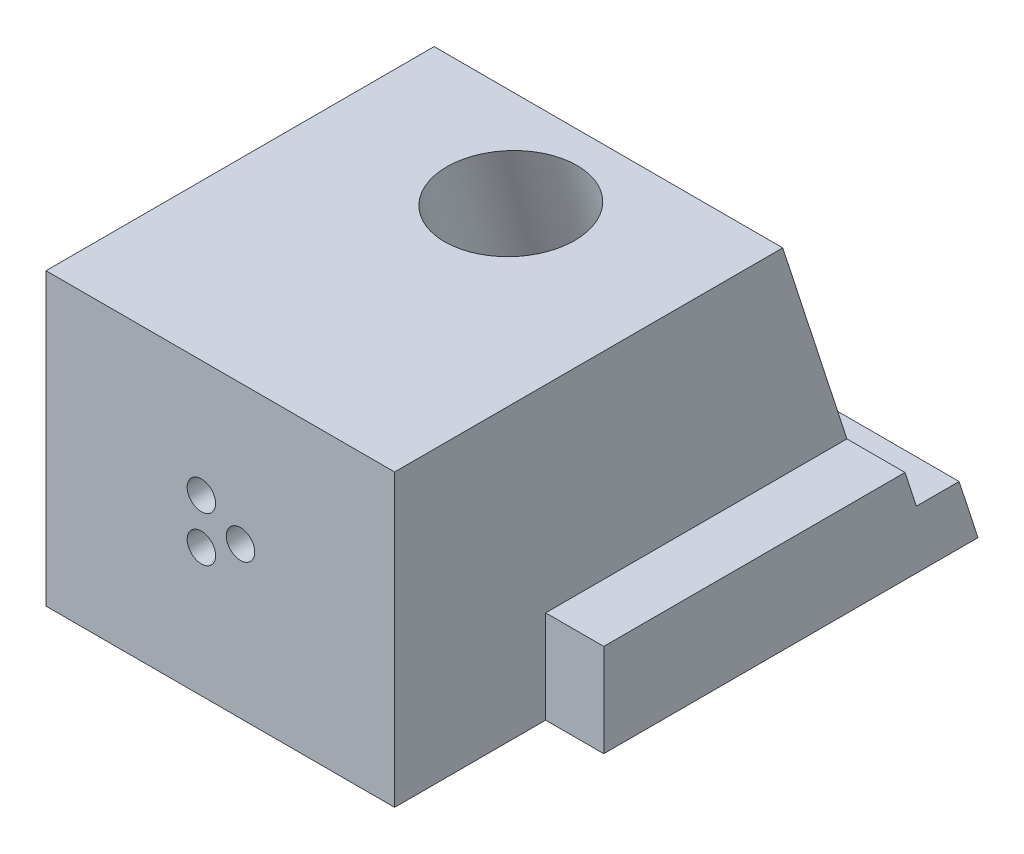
ISO-10303-21;
HEADER;
FILE_DESCRIPTION(('STEP AP214'),'2;1');
FILE_NAME('part.step','',(''),(''),'','','');
FILE_SCHEMA(('AUTOMOTIVE_DESIGN { 1 0 10303 214 1 1 1 1 }'));
ENDSEC;
DATA;
#1=APPLICATION_CONTEXT('core data for automotive mechanical design processes');
#2=APPLICATION_PROTOCOL_DEFINITION('international standard','automotive_design',2000,#1);
#3=PRODUCT_CONTEXT('',#1,'mechanical');
#4=PRODUCT('Part','Part','',(#3));
#5=PRODUCT_RELATED_PRODUCT_CATEGORY('part','',(#4));
#6=PRODUCT_DEFINITION_FORMATION('','',#4);
#7=PRODUCT_DEFINITION_CONTEXT('part definition',#1,'design');
#8=PRODUCT_DEFINITION('design','',#6,#7);
#9=PRODUCT_DEFINITION_SHAPE('','',#8);
#10=(LENGTH_UNIT() NAMED_UNIT(*) SI_UNIT(.MILLI.,.METRE.));
#11=(NAMED_UNIT(*) PLANE_ANGLE_UNIT() SI_UNIT($,.RADIAN.));
#12=(NAMED_UNIT(*) SI_UNIT($,.STERADIAN.) SOLID_ANGLE_UNIT());
#13=UNCERTAINTY_MEASURE_WITH_UNIT(LENGTH_MEASURE(1.E-05),#10,'distance_accuracy_value','');
#14=(GEOMETRIC_REPRESENTATION_CONTEXT(3) GLOBAL_UNCERTAINTY_ASSIGNED_CONTEXT((#13)) GLOBAL_UNIT_ASSIGNED_CONTEXT((#10,
#11,#12)) REPRESENTATION_CONTEXT('',''));
#15=CARTESIAN_POINT('',(0.,0.,0.));
#16=DIRECTION('',(0.,0.,1.));
#17=DIRECTION('',(1.,0.,0.));
#18=AXIS2_PLACEMENT_3D('',#15,#16,#17);
#19=CARTESIAN_POINT('',(-10.,-5.,-108.665097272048));
#20=DIRECTION('',(1.,0.,0.));
#21=DIRECTION('',(0.,1.,0.));
#22=AXIS2_PLACEMENT_3D('',#19,#20,#21);
#23=PLANE('',#22);
#24=DIRECTION('',(0.,0.951056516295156,0.309016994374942));
#25=VECTOR('',#24,1.);
#26=CARTESIAN_POINT('',(-10.,-17.6789576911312,-69.6432779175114));
#27=LINE('',#26,#25);
#28=CARTESIAN_POINT('',(-10.,-13.,-68.1229924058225));
#29=VERTEX_POINT('',#28);
#30=CARTESIAN_POINT('',(-9.99999999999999,-8.,-66.498393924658));
#31=VERTEX_POINT('',#30);
#32=EDGE_CURVE('E211',#29,#31,#27,.T.);
#33=ORIENTED_EDGE('',*,*,#32,.T.);
#34=DIRECTION('',(0.,0.,1.));
#35=VECTOR('',#34,1.);
#36=CARTESIAN_POINT('',(-9.99999999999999,-8.,-62.8182761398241));
#37=LINE('',#36,#35);
#38=CARTESIAN_POINT('',(-9.99999999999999,-8.,-62.8182761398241));
#39=VERTEX_POINT('',#38);
#40=EDGE_CURVE('E152',#31,#39,#37,.T.);
#41=ORIENTED_EDGE('',*,*,#40,.T.);
#42=DIRECTION('',(0.,0.951056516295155,0.309016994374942));
#43=VECTOR('',#42,1.);
#44=CARTESIAN_POINT('',(-9.99999999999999,12.,-56.3198822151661));
#45=LINE('',#44,#43);
#46=CARTESIAN_POINT('',(-9.99999999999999,-5.,-61.8435170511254));
#47=VERTEX_POINT('',#46);
#48=EDGE_CURVE('E155',#39,#47,#45,.T.);
#49=ORIENTED_EDGE('',*,*,#48,.T.);
#50=DIRECTION('',(0.,0.,1.));
#51=VECTOR('',#50,1.);
#52=CARTESIAN_POINT('',(-10.,-5.,-108.665097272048));
#53=LINE('',#52,#51);
#54=CARTESIAN_POINT('',(-10.,-5.,-35.9174140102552));
#55=VERTEX_POINT('',#54);
#56=EDGE_CURVE('E214',#47,#55,#53,.T.);
#57=ORIENTED_EDGE('',*,*,#56,.T.);
#58=DIRECTION('',(0.,1.,0.));
#59=VECTOR('',#58,1.);
#60=CARTESIAN_POINT('',(-10.,-13.,-35.9174140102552));
#61=LINE('',#60,#59);
#62=CARTESIAN_POINT('',(-10.,-13.,-35.9174140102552));
#63=VERTEX_POINT('',#62);
#64=EDGE_CURVE('E183',#63,#55,#61,.T.);
#65=ORIENTED_EDGE('',*,*,#64,.F.);
#66=DIRECTION('',(0.,0.,1.));
#67=VECTOR('',#66,1.);
#68=CARTESIAN_POINT('',(-10.,-13.,-108.665097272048));
#69=LINE('',#68,#67);
#70=EDGE_CURVE('E215',#29,#63,#69,.T.);
#71=ORIENTED_EDGE('',*,*,#70,.F.);
#72=EDGE_LOOP('',(#33,#41,#49,#57,#65,#71));
#73=FACE_BOUND('',#72,.T.);
#74=ADVANCED_FACE('F35',(#73),#23,.T.);
#75=CARTESIAN_POINT('',(-10.,-5.,-108.665097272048));
#76=DIRECTION('',(0.,1.,0.));
#77=DIRECTION('',(-1.,0.,0.));
#78=AXIS2_PLACEMENT_3D('',#75,#76,#77);
#79=PLANE('',#78);
#80=ORIENTED_EDGE('',*,*,#56,.F.);
#81=DIRECTION('',(-1.,0.,0.));
#82=VECTOR('',#81,1.);
#83=CARTESIAN_POINT('',(-10.,-5.,-61.8435170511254));
#84=LINE('',#83,#82);
#85=CARTESIAN_POINT('',(-15.,-5.,-61.8435170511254));
#86=VERTEX_POINT('',#85);
#87=EDGE_CURVE('E173',#47,#86,#84,.T.);
#88=ORIENTED_EDGE('',*,*,#87,.T.);
#89=DIRECTION('',(0.,0.,1.));
#90=VECTOR('',#89,1.);
#91=CARTESIAN_POINT('',(-15.,-5.,-35.));
#92=LINE('',#91,#90);
#93=CARTESIAN_POINT('',(-15.,-5.,-35.9174140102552));
#94=VERTEX_POINT('',#93);
#95=EDGE_CURVE('E227',#86,#94,#92,.T.);
#96=ORIENTED_EDGE('',*,*,#95,.T.);
#97=DIRECTION('',(-1.,0.,0.));
#98=VECTOR('',#97,1.);
#99=CARTESIAN_POINT('',(-10.,-5.,-35.9174140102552));
#100=LINE('',#99,#98);
#101=EDGE_CURVE('E186',#55,#94,#100,.T.);
#102=ORIENTED_EDGE('',*,*,#101,.F.);
#103=EDGE_LOOP('',(#80,#88,#96,#102));
#104=FACE_BOUND('',#103,.T.);
#105=ADVANCED_FACE('F297',(#104),#79,.T.);
#106=CARTESIAN_POINT('',(-45.,-22.,-35.));
#107=DIRECTION('',(-1.,0.,0.));
#108=DIRECTION('',(0.,0.,1.));
#109=AXIS2_PLACEMENT_3D('',#106,#107,#108);
#110=PLANE('',#109);
#111=DIRECTION('',(0.,0.,1.));
#112=VECTOR('',#111,1.);
#113=CARTESIAN_POINT('',(-45.,12.,-35.));
#114=LINE('',#113,#112);
#115=CARTESIAN_POINT('',(-45.,12.,-56.3198822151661));
#116=VERTEX_POINT('',#115);
#117=CARTESIAN_POINT('',(-45.,12.,-22.9174140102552));
#118=VERTEX_POINT('',#117);
#119=EDGE_CURVE('E232',#116,#118,#114,.T.);
#120=ORIENTED_EDGE('',*,*,#119,.F.);
#121=DIRECTION('',(0.,-0.951056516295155,-0.309016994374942));
#122=VECTOR('',#121,1.);
#123=CARTESIAN_POINT('',(-45.,-12.4875327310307,-64.2763639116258));
#124=LINE('',#123,#122);
#125=CARTESIAN_POINT('',(-45.,-5.,-61.8435170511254));
#126=VERTEX_POINT('',#125);
#127=EDGE_CURVE('E167',#116,#126,#124,.T.);
#128=ORIENTED_EDGE('',*,*,#127,.T.);
#129=DIRECTION('',(0.,0.,-1.));
#130=VECTOR('',#129,1.);
#131=CARTESIAN_POINT('',(-45.,-5.,-35.));
#132=LINE('',#131,#130);
#133=CARTESIAN_POINT('',(-45.,-5.,-35.9174140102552));
#134=VERTEX_POINT('',#133);
#135=EDGE_CURVE('E229',#134,#126,#132,.T.);
#136=ORIENTED_EDGE('',*,*,#135,.F.);
#137=DIRECTION('',(0.,1.,0.));
#138=VECTOR('',#137,1.);
#139=CARTESIAN_POINT('',(-45.,-13.,-35.9174140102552));
#140=LINE('',#139,#138);
#141=CARTESIAN_POINT('',(-45.,-13.,-35.9174140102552));
#142=VERTEX_POINT('',#141);
#143=EDGE_CURVE('E199',#142,#134,#140,.T.);
#144=ORIENTED_EDGE('',*,*,#143,.F.);
#145=DIRECTION('',(0.,0.,1.));
#146=VECTOR('',#145,1.);
#147=CARTESIAN_POINT('',(-45.,-13.,-35.9174140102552));
#148=LINE('',#147,#146);
#149=CARTESIAN_POINT('',(-45.,-13.,-22.9174140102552));
#150=VERTEX_POINT('',#149);
#151=EDGE_CURVE('E204',#142,#150,#148,.T.);
#152=ORIENTED_EDGE('',*,*,#151,.T.);
#153=DIRECTION('',(0.,1.,0.));
#154=VECTOR('',#153,1.);
#155=CARTESIAN_POINT('',(-45.,-22.,-22.9174140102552));
#156=LINE('',#155,#154);
#157=EDGE_CURVE('E240',#150,#118,#156,.T.);
#158=ORIENTED_EDGE('',*,*,#157,.T.);
#159=EDGE_LOOP('',(#120,#128,#136,#144,#152,#158));
#160=FACE_BOUND('',#159,.T.);
#161=ADVANCED_FACE('F286',(#160),#110,.T.);
#162=CARTESIAN_POINT('',(-15.,-22.,-35.));
#163=DIRECTION('',(1.,0.,0.));
#164=DIRECTION('',(0.,0.,-1.));
#165=AXIS2_PLACEMENT_3D('',#162,#163,#164);
#166=PLANE('',#165);
#167=ORIENTED_EDGE('',*,*,#95,.F.);
#168=DIRECTION('',(0.,0.951056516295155,0.309016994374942));
#169=VECTOR('',#168,1.);
#170=CARTESIAN_POINT('',(-15.,-12.4875327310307,-64.2763639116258));
#171=LINE('',#170,#169);
#172=CARTESIAN_POINT('',(-15.,12.,-56.3198822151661));
#173=VERTEX_POINT('',#172);
#174=EDGE_CURVE('E170',#86,#173,#171,.T.);
#175=ORIENTED_EDGE('',*,*,#174,.T.);
#176=DIRECTION('',(0.,0.,-1.));
#177=VECTOR('',#176,1.);
#178=CARTESIAN_POINT('',(-15.,12.,-22.9174140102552));
#179=LINE('',#178,#177);
#180=CARTESIAN_POINT('',(-15.,12.,-22.9174140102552));
#181=VERTEX_POINT('',#180);
#182=EDGE_CURVE('E237',#181,#173,#179,.T.);
#183=ORIENTED_EDGE('',*,*,#182,.F.);
#184=DIRECTION('',(0.,1.,0.));
#185=VECTOR('',#184,1.);
#186=CARTESIAN_POINT('',(-15.,-22.,-22.9174140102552));
#187=LINE('',#186,#185);
#188=CARTESIAN_POINT('',(-15.,-13.,-22.9174140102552));
#189=VERTEX_POINT('',#188);
#190=EDGE_CURVE('E241',#189,#181,#187,.T.);
#191=ORIENTED_EDGE('',*,*,#190,.F.);
#192=DIRECTION('',(0.,0.,1.));
#193=VECTOR('',#192,1.);
#194=CARTESIAN_POINT('',(-15.,-13.,-35.9174140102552));
#195=LINE('',#194,#193);
#196=CARTESIAN_POINT('',(-15.,-13.,-35.9174140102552));
#197=VERTEX_POINT('',#196);
#198=EDGE_CURVE('E191',#197,#189,#195,.T.);
#199=ORIENTED_EDGE('',*,*,#198,.F.);
#200=DIRECTION('',(0.,-1.,0.));
#201=VECTOR('',#200,1.);
#202=CARTESIAN_POINT('',(-15.,-13.,-35.9174140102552));
#203=LINE('',#202,#201);
#204=EDGE_CURVE('E58',#94,#197,#203,.T.);
#205=ORIENTED_EDGE('',*,*,#204,.F.);
#206=EDGE_LOOP('',(#167,#175,#183,#191,#199,#205));
#207=FACE_BOUND('',#206,.T.);
#208=ADVANCED_FACE('F294',(#207),#166,.T.);
#209=CARTESIAN_POINT('',(-45.,12.,-35.));
#210=DIRECTION('',(0.,1.,0.));
#211=DIRECTION('',(0.,0.,1.));
#212=AXIS2_PLACEMENT_3D('',#209,#210,#211);
#213=PLANE('',#212);
#214=CARTESIAN_POINT('',(-30.,12.,-47.9174140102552));
#215=DIRECTION('',(0.,1.,0.));
#216=DIRECTION('',(0.,0.,1.));
#217=AXIS2_PLACEMENT_3D('',#214,#215,#216);
#218=ELLIPSE('',#217,5.69401899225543,5.5);
#219=CARTESIAN_POINT('',(-30.,12.,-42.2233950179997));
#220=VERTEX_POINT('',#219);
#221=EDGE_CURVE('E180',#220,#220,#218,.T.);
#222=ORIENTED_EDGE('',*,*,#221,.F.);
#223=EDGE_LOOP('',(#222));
#224=FACE_BOUND('',#223,.T.);
#225=ORIENTED_EDGE('',*,*,#182,.T.);
#226=DIRECTION('',(1.,0.,0.));
#227=VECTOR('',#226,1.);
#228=CARTESIAN_POINT('',(-55.,12.,-56.3198822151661));
#229=LINE('',#228,#227);
#230=EDGE_CURVE('E158',#116,#173,#229,.T.);
#231=ORIENTED_EDGE('',*,*,#230,.F.);
#232=ORIENTED_EDGE('',*,*,#119,.T.);
#233=DIRECTION('',(1.,0.,0.));
#234=VECTOR('',#233,1.);
#235=CARTESIAN_POINT('',(-45.,12.,-22.9174140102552));
#236=LINE('',#235,#234);
#237=EDGE_CURVE('E234',#118,#181,#236,.T.);
#238=ORIENTED_EDGE('',*,*,#237,.T.);
#239=EDGE_LOOP('',(#225,#231,#232,#238));
#240=FACE_BOUND('',#239,.T.);
#241=ADVANCED_FACE('F289',(#224,#240),#213,.T.);
#242=CARTESIAN_POINT('',(-80.749715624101,12.,-60.));
#243=DIRECTION('',(0.,0.309016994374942,-0.951056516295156));
#244=DIRECTION('',(0.,0.951056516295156,0.309016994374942));
#245=AXIS2_PLACEMENT_3D('',#242,#243,#244);
#246=PLANE('',#245);
#247=DIRECTION('',(0.,-0.951056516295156,-0.309016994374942));
#248=VECTOR('',#247,1.);
#249=CARTESIAN_POINT('',(-50.,-17.6789576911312,-69.6432779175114));
#250=LINE('',#249,#248);
#251=CARTESIAN_POINT('',(-50.,-8.,-66.498393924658));
#252=VERTEX_POINT('',#251);
#253=CARTESIAN_POINT('',(-50.,-13.,-68.1229924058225));
#254=VERTEX_POINT('',#253);
#255=EDGE_CURVE('E219',#252,#254,#250,.T.);
#256=ORIENTED_EDGE('',*,*,#255,.F.);
#257=DIRECTION('',(1.,0.,0.));
#258=VECTOR('',#257,1.);
#259=CARTESIAN_POINT('',(-55.,-8.,-66.498393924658));
#260=LINE('',#259,#258);
#261=EDGE_CURVE('E161',#252,#31,#260,.T.);
#262=ORIENTED_EDGE('',*,*,#261,.T.);
#263=ORIENTED_EDGE('',*,*,#32,.F.);
#264=DIRECTION('',(1.,0.,0.));
#265=VECTOR('',#264,1.);
#266=CARTESIAN_POINT('',(-10.,-13.,-68.1229924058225));
#267=LINE('',#266,#265);
#268=EDGE_CURVE('E216',#254,#29,#267,.T.);
#269=ORIENTED_EDGE('',*,*,#268,.F.);
#270=EDGE_LOOP('',(#256,#262,#263,#269));
#271=FACE_BOUND('',#270,.T.);
#272=ADVANCED_FACE('F311',(#271),#246,.T.);
#273=ORIENTED_EDGE('',*,*,#135,.T.);
#274=DIRECTION('',(-1.,0.,0.));
#275=VECTOR('',#274,1.);
#276=CARTESIAN_POINT('',(-10.,-5.,-61.8435170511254));
#277=LINE('',#276,#275);
#278=CARTESIAN_POINT('',(-50.,-5.,-61.8435170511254));
#279=VERTEX_POINT('',#278);
#280=EDGE_CURVE('E164',#126,#279,#277,.T.);
#281=ORIENTED_EDGE('',*,*,#280,.T.);
#282=DIRECTION('',(0.,0.,1.));
#283=VECTOR('',#282,1.);
#284=CARTESIAN_POINT('',(-50.,-5.,-108.665097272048));
#285=LINE('',#284,#283);
#286=CARTESIAN_POINT('',(-50.,-5.,-35.9174140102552));
#287=VERTEX_POINT('',#286);
#288=EDGE_CURVE('E210',#279,#287,#285,.T.);
#289=ORIENTED_EDGE('',*,*,#288,.T.);
#290=DIRECTION('',(-1.,0.,0.));
#291=VECTOR('',#290,1.);
#292=CARTESIAN_POINT('',(-50.,-5.,-35.9174140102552));
#293=LINE('',#292,#291);
#294=EDGE_CURVE('E201',#134,#287,#293,.T.);
#295=ORIENTED_EDGE('',*,*,#294,.F.);
#296=EDGE_LOOP('',(#273,#281,#289,#295));
#297=FACE_BOUND('',#296,.T.);
#298=ADVANCED_FACE('F281',(#297),#79,.T.);
#299=CARTESIAN_POINT('',(-50.,-5.,-108.665097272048));
#300=DIRECTION('',(-1.,0.,0.));
#301=DIRECTION('',(0.,0.,1.));
#302=AXIS2_PLACEMENT_3D('',#299,#300,#301);
#303=PLANE('',#302);
#304=DIRECTION('',(0.,-0.951056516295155,-0.309016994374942));
#305=VECTOR('',#304,1.);
#306=CARTESIAN_POINT('',(-50.,-18.7605171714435,-66.3145801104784));
#307=LINE('',#306,#305);
#308=CARTESIAN_POINT('',(-50.,-8.,-62.8182761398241));
#309=VERTEX_POINT('',#308);
#310=EDGE_CURVE('E43',#279,#309,#307,.T.);
#311=ORIENTED_EDGE('',*,*,#310,.T.);
#312=DIRECTION('',(0.,0.,-1.));
#313=VECTOR('',#312,1.);
#314=CARTESIAN_POINT('',(-50.,-8.,-108.665097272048));
#315=LINE('',#314,#313);
#316=EDGE_CURVE('E12',#309,#252,#315,.T.);
#317=ORIENTED_EDGE('',*,*,#316,.T.);
#318=ORIENTED_EDGE('',*,*,#255,.T.);
#319=DIRECTION('',(0.,0.,1.));
#320=VECTOR('',#319,1.);
#321=CARTESIAN_POINT('',(-50.,-13.,-108.665097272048));
#322=LINE('',#321,#320);
#323=CARTESIAN_POINT('',(-50.,-13.,-35.9174140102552));
#324=VERTEX_POINT('',#323);
#325=EDGE_CURVE('E218',#254,#324,#322,.T.);
#326=ORIENTED_EDGE('',*,*,#325,.T.);
#327=DIRECTION('',(0.,-1.,0.));
#328=VECTOR('',#327,1.);
#329=CARTESIAN_POINT('',(-50.,-13.,-35.9174140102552));
#330=LINE('',#329,#328);
#331=EDGE_CURVE('E194',#287,#324,#330,.T.);
#332=ORIENTED_EDGE('',*,*,#331,.F.);
#333=ORIENTED_EDGE('',*,*,#288,.F.);
#334=EDGE_LOOP('',(#311,#317,#318,#326,#332,#333));
#335=FACE_BOUND('',#334,.T.);
#336=ADVANCED_FACE('F276',(#335),#303,.T.);
#337=CARTESIAN_POINT('',(-30.5060153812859,0.000361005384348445,-22.9174140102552));
#338=DIRECTION('',(0.,0.,-1.));
#339=DIRECTION('',(0.,-1.,0.));
#340=AXIS2_PLACEMENT_3D('',#337,#338,#339);
#341=PLANE('',#340);
#342=DIRECTION('',(1.,0.,0.));
#343=VECTOR('',#342,1.);
#344=CARTESIAN_POINT('',(-10.,-13.,-22.9174140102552));
#345=LINE('',#344,#343);
#346=EDGE_CURVE('E207',#150,#189,#345,.T.);
#347=ORIENTED_EDGE('',*,*,#346,.T.);
#348=ORIENTED_EDGE('',*,*,#190,.T.);
#349=ORIENTED_EDGE('',*,*,#237,.F.);
#350=ORIENTED_EDGE('',*,*,#157,.F.);
#351=EDGE_LOOP('',(#347,#348,#349,#350));
#352=FACE_BOUND('',#351,.T.);
#353=CARTESIAN_POINT('',(-31.6280153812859,1.94372201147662,-22.9174140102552));
#354=DIRECTION('',(0.,0.,-1.));
#355=DIRECTION('',(0.866025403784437,0.500000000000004,0.));
#356=AXIS2_PLACEMENT_3D('',#353,#354,#355);
#357=CIRCLE('',#356,1.224);
#358=CARTESIAN_POINT('',(-30.5680002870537,2.55572201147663,-22.9174140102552));
#359=VERTEX_POINT('',#358);
#360=EDGE_CURVE('E248',#359,#359,#357,.T.);
#361=ORIENTED_EDGE('',*,*,#360,.T.);
#362=EDGE_LOOP('',(#361));
#363=FACE_BOUND('',#362,.T.);
#364=CARTESIAN_POINT('',(-28.2620153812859,0.000361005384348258,-22.9174140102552));
#365=DIRECTION('',(0.,0.,-1.));
#366=DIRECTION('',(0.,-1.,0.));
#367=AXIS2_PLACEMENT_3D('',#364,#365,#366);
#368=CIRCLE('',#367,1.224);
#369=CARTESIAN_POINT('',(-28.2620153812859,-1.22363899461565,-22.9174140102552));
#370=VERTEX_POINT('',#369);
#371=EDGE_CURVE('E251',#370,#370,#368,.T.);
#372=ORIENTED_EDGE('',*,*,#371,.T.);
#373=EDGE_LOOP('',(#372));
#374=FACE_BOUND('',#373,.T.);
#375=CARTESIAN_POINT('',(-31.6280153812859,-1.94300000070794,-22.9174140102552));
#376=DIRECTION('',(0.,0.,-1.));
#377=DIRECTION('',(-0.866025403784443,0.499999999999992,0.));
#378=AXIS2_PLACEMENT_3D('',#375,#376,#377);
#379=CIRCLE('',#378,1.224);
#380=CARTESIAN_POINT('',(-32.688030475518,-1.33100000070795,-22.9174140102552));
#381=VERTEX_POINT('',#380);
#382=EDGE_CURVE('E243',#381,#381,#379,.T.);
#383=ORIENTED_EDGE('',*,*,#382,.T.);
#384=EDGE_LOOP('',(#383));
#385=FACE_BOUND('',#384,.T.);
#386=ADVANCED_FACE('F37',(#352,#363,#374,#385),#341,.F.);
#387=CARTESIAN_POINT('',(-28.2620153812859,0.000361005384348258,-22.9174140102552));
#388=DIRECTION('',(0.,0.,1.));
#389=DIRECTION('',(0.,-1.,0.));
#390=AXIS2_PLACEMENT_3D('',#387,#388,#389);
#391=CONICAL_SURFACE('',#390,1.224,0.0174532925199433);
#392=CARTESIAN_POINT('',(-28.2620153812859,0.000361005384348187,-26.4963147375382));
#393=DIRECTION('',(0.,0.,1.));
#394=DIRECTION('',(0.,1.,0.));
#395=AXIS2_PLACEMENT_3D('',#392,#393,#394);
#396=CIRCLE('',#395,1.16153005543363);
#397=CARTESIAN_POINT('',(-28.2620153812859,1.16189106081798,-26.4963147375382));
#398=VERTEX_POINT('',#397);
#399=EDGE_CURVE('E257',#398,#398,#396,.T.);
#400=ORIENTED_EDGE('',*,*,#399,.F.);
#401=EDGE_LOOP('',(#400));
#402=FACE_BOUND('',#401,.T.);
#403=ORIENTED_EDGE('',*,*,#371,.F.);
#404=EDGE_LOOP('',(#403));
#405=FACE_BOUND('',#404,.T.);
#406=ADVANCED_FACE('F381',(#402,#405),#391,.F.);
#407=CARTESIAN_POINT('',(-28.2620153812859,0.000361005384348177,-26.9974140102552));
#408=DIRECTION('',(0.,0.,-1.));
#409=DIRECTION('',(0.,-1.,0.));
#410=AXIS2_PLACEMENT_3D('',#407,#408,#409);
#411=PLANE('',#410);
#412=CARTESIAN_POINT('',(-28.2620153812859,0.000361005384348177,-26.9974140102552));
#413=DIRECTION('',(0.,0.,-1.));
#414=DIRECTION('',(0.,-1.,0.));
#415=AXIS2_PLACEMENT_3D('',#412,#413,#414);
#416=CIRCLE('',#415,0.65160773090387);
#417=CARTESIAN_POINT('',(-28.2620153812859,-0.651246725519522,-26.9974140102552));
#418=VERTEX_POINT('',#417);
#419=EDGE_CURVE('E254',#418,#418,#416,.T.);
#420=ORIENTED_EDGE('',*,*,#419,.F.);
#421=EDGE_LOOP('',(#420));
#422=FACE_BOUND('',#421,.T.);
#423=ADVANCED_FACE('F378',(#422),#411,.F.);
#424=CARTESIAN_POINT('',(-28.2620153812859,0.000361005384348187,-26.4874140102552));
#425=DIRECTION('',(0.,0.,-1.));
#426=DIRECTION('',(0.,-1.,0.));
#427=AXIS2_PLACEMENT_3D('',#424,#425,#426);
#428=TOROIDAL_SURFACE('',#427,0.65160773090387,0.51);
#429=ORIENTED_EDGE('',*,*,#399,.T.);
#430=EDGE_LOOP('',(#429));
#431=FACE_BOUND('',#430,.T.);
#432=ORIENTED_EDGE('',*,*,#419,.T.);
#433=EDGE_LOOP('',(#432));
#434=FACE_BOUND('',#433,.T.);
#435=ADVANCED_FACE('F374',(#431,#434),#428,.F.);
#436=CARTESIAN_POINT('',(-31.6280153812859,1.94372201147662,-22.9174140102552));
#437=DIRECTION('',(0.,0.,1.));
#438=DIRECTION('',(0.866025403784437,0.500000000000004,0.));
#439=AXIS2_PLACEMENT_3D('',#436,#437,#438);
#440=CONICAL_SURFACE('',#439,1.224,0.0174532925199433);
#441=CARTESIAN_POINT('',(-31.6280153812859,1.94372201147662,-26.4963147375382));
#442=DIRECTION('',(0.,0.,1.));
#443=DIRECTION('',(0.,1.,0.));
#444=AXIS2_PLACEMENT_3D('',#441,#442,#443);
#445=CIRCLE('',#444,1.16153005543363);
#446=CARTESIAN_POINT('',(-31.6280153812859,3.10525206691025,-26.4963147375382));
#447=VERTEX_POINT('',#446);
#448=EDGE_CURVE('E263',#447,#447,#445,.T.);
#449=ORIENTED_EDGE('',*,*,#448,.F.);
#450=EDGE_LOOP('',(#449));
#451=FACE_BOUND('',#450,.T.);
#452=ORIENTED_EDGE('',*,*,#360,.F.);
#453=EDGE_LOOP('',(#452));
#454=FACE_BOUND('',#453,.T.);
#455=ADVANCED_FACE('F370',(#451,#454),#440,.F.);
#456=CARTESIAN_POINT('',(-31.6280153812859,1.94372201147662,-26.9974140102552));
#457=DIRECTION('',(0.,0.,-1.));
#458=DIRECTION('',(0.866025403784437,0.500000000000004,0.));
#459=AXIS2_PLACEMENT_3D('',#456,#457,#458);
#460=PLANE('',#459);
#461=CARTESIAN_POINT('',(-31.6280153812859,1.94372201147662,-26.9974140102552));
#462=DIRECTION('',(0.,0.,-1.));
#463=DIRECTION('',(0.,-1.,0.));
#464=AXIS2_PLACEMENT_3D('',#461,#462,#463);
#465=CIRCLE('',#464,0.65160773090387);
#466=CARTESIAN_POINT('',(-31.6280153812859,1.29211428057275,-26.9974140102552));
#467=VERTEX_POINT('',#466);
#468=EDGE_CURVE('E260',#467,#467,#465,.T.);
#469=ORIENTED_EDGE('',*,*,#468,.F.);
#470=EDGE_LOOP('',(#469));
#471=FACE_BOUND('',#470,.T.);
#472=ADVANCED_FACE('F366',(#471),#460,.F.);
#473=CARTESIAN_POINT('',(-31.6280153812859,-1.94300000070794,-22.9174140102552));
#474=DIRECTION('',(0.,0.,1.));
#475=DIRECTION('',(-0.866025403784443,0.499999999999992,0.));
#476=AXIS2_PLACEMENT_3D('',#473,#474,#475);
#477=CONICAL_SURFACE('',#476,1.224,0.0174532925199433);
#478=CARTESIAN_POINT('',(-31.6280153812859,-1.94300000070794,-26.4963147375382));
#479=DIRECTION('',(0.,0.,1.));
#480=DIRECTION('',(0.,1.,0.));
#481=AXIS2_PLACEMENT_3D('',#478,#479,#480);
#482=CIRCLE('',#481,1.16153005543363);
#483=CARTESIAN_POINT('',(-31.6280153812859,-0.781469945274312,-26.4963147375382));
#484=VERTEX_POINT('',#483);
#485=EDGE_CURVE('E269',#484,#484,#482,.T.);
#486=ORIENTED_EDGE('',*,*,#485,.F.);
#487=EDGE_LOOP('',(#486));
#488=FACE_BOUND('',#487,.T.);
#489=ORIENTED_EDGE('',*,*,#382,.F.);
#490=EDGE_LOOP('',(#489));
#491=FACE_BOUND('',#490,.T.);
#492=ADVANCED_FACE('F362',(#488,#491),#477,.F.);
#493=CARTESIAN_POINT('',(-31.6280153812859,-1.94300000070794,-26.9974140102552));
#494=DIRECTION('',(0.,0.,-1.));
#495=DIRECTION('',(-0.866025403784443,0.499999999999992,0.));
#496=AXIS2_PLACEMENT_3D('',#493,#494,#495);
#497=PLANE('',#496);
#498=CARTESIAN_POINT('',(-31.6280153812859,-1.94300000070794,-26.9974140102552));
#499=DIRECTION('',(0.,0.,-1.));
#500=DIRECTION('',(0.,-1.,0.));
#501=AXIS2_PLACEMENT_3D('',#498,#499,#500);
#502=CIRCLE('',#501,0.65160773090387);
#503=CARTESIAN_POINT('',(-31.6280153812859,-2.59460773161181,-26.9974140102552));
#504=VERTEX_POINT('',#503);
#505=EDGE_CURVE('E266',#504,#504,#502,.T.);
#506=ORIENTED_EDGE('',*,*,#505,.F.);
#507=EDGE_LOOP('',(#506));
#508=FACE_BOUND('',#507,.T.);
#509=ADVANCED_FACE('F358',(#508),#497,.F.);
#510=CARTESIAN_POINT('',(-31.6280153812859,1.94372201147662,-26.4874140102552));
#511=DIRECTION('',(0.,0.,-1.));
#512=DIRECTION('',(0.,-1.,0.));
#513=AXIS2_PLACEMENT_3D('',#510,#511,#512);
#514=TOROIDAL_SURFACE('',#513,0.65160773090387,0.51);
#515=ORIENTED_EDGE('',*,*,#448,.T.);
#516=EDGE_LOOP('',(#515));
#517=FACE_BOUND('',#516,.T.);
#518=ORIENTED_EDGE('',*,*,#468,.T.);
#519=EDGE_LOOP('',(#518));
#520=FACE_BOUND('',#519,.T.);
#521=ADVANCED_FACE('F354',(#517,#520),#514,.F.);
#522=CARTESIAN_POINT('',(-31.6280153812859,-1.94300000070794,-26.4874140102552));
#523=DIRECTION('',(0.,0.,-1.));
#524=DIRECTION('',(0.,-1.,0.));
#525=AXIS2_PLACEMENT_3D('',#522,#523,#524);
#526=TOROIDAL_SURFACE('',#525,0.65160773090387,0.51);
#527=ORIENTED_EDGE('',*,*,#485,.T.);
#528=EDGE_LOOP('',(#527));
#529=FACE_BOUND('',#528,.T.);
#530=ORIENTED_EDGE('',*,*,#505,.T.);
#531=EDGE_LOOP('',(#530));
#532=FACE_BOUND('',#531,.T.);
#533=ADVANCED_FACE('F339',(#529,#532),#526,.F.);
#534=CARTESIAN_POINT('',(-10.,-13.,-108.665097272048));
#535=DIRECTION('',(0.,-1.,0.));
#536=DIRECTION('',(1.,0.,0.));
#537=AXIS2_PLACEMENT_3D('',#534,#535,#536);
#538=PLANE('',#537);
#539=CARTESIAN_POINT('',(-30.,-13.,-32.7174140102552));
#540=DIRECTION('',(0.,-1.,0.));
#541=DIRECTION('',(1.,0.,0.));
#542=AXIS2_PLACEMENT_3D('',#539,#540,#541);
#543=CIRCLE('',#542,2.);
#544=CARTESIAN_POINT('',(-28.,-13.,-32.7174140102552));
#545=VERTEX_POINT('',#544);
#546=EDGE_CURVE('E176',#545,#545,#543,.T.);
#547=ORIENTED_EDGE('',*,*,#546,.F.);
#548=EDGE_LOOP('',(#547));
#549=FACE_BOUND('',#548,.T.);
#550=CARTESIAN_POINT('',(-30.,-13.,-54.6161438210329));
#551=DIRECTION('',(0.,-1.,0.));
#552=DIRECTION('',(0.,0.,1.));
#553=AXIS2_PLACEMENT_3D('',#550,#551,#552);
#554=ELLIPSE('',#553,5.69401899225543,5.5);
#555=CARTESIAN_POINT('',(-30.,-13.,-48.9221248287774));
#556=VERTEX_POINT('',#555);
#557=EDGE_CURVE('E179',#556,#556,#554,.T.);
#558=ORIENTED_EDGE('',*,*,#557,.F.);
#559=EDGE_LOOP('',(#558));
#560=FACE_BOUND('',#559,.T.);
#561=ORIENTED_EDGE('',*,*,#198,.T.);
#562=ORIENTED_EDGE('',*,*,#346,.F.);
#563=ORIENTED_EDGE('',*,*,#151,.F.);
#564=DIRECTION('',(1.,0.,0.));
#565=VECTOR('',#564,1.);
#566=CARTESIAN_POINT('',(-50.,-13.,-35.9174140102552));
#567=LINE('',#566,#565);
#568=EDGE_CURVE('E196',#324,#142,#567,.T.);
#569=ORIENTED_EDGE('',*,*,#568,.F.);
#570=ORIENTED_EDGE('',*,*,#325,.F.);
#571=ORIENTED_EDGE('',*,*,#268,.T.);
#572=ORIENTED_EDGE('',*,*,#70,.T.);
#573=DIRECTION('',(1.,0.,0.));
#574=VECTOR('',#573,1.);
#575=CARTESIAN_POINT('',(-10.,-13.,-35.9174140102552));
#576=LINE('',#575,#574);
#577=EDGE_CURVE('E189',#197,#63,#576,.T.);
#578=ORIENTED_EDGE('',*,*,#577,.F.);
#579=EDGE_LOOP('',(#561,#562,#563,#569,#570,#571,#572,#578));
#580=FACE_BOUND('',#579,.T.);
#581=ADVANCED_FACE('F305',(#549,#560,#580),#538,.T.);
#582=CARTESIAN_POINT('',(-50.,-5.,-35.9174140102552));
#583=DIRECTION('',(0.,0.,-1.));
#584=DIRECTION('',(-1.,0.,0.));
#585=AXIS2_PLACEMENT_3D('',#582,#583,#584);
#586=PLANE('',#585);
#587=ORIENTED_EDGE('',*,*,#331,.T.);
#588=ORIENTED_EDGE('',*,*,#568,.T.);
#589=ORIENTED_EDGE('',*,*,#143,.T.);
#590=ORIENTED_EDGE('',*,*,#294,.T.);
#591=EDGE_LOOP('',(#587,#588,#589,#590));
#592=FACE_BOUND('',#591,.T.);
#593=ADVANCED_FACE('F335',(#592),#586,.F.);
#594=CARTESIAN_POINT('',(-10.,-5.,-35.9174140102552));
#595=DIRECTION('',(0.,0.,1.));
#596=DIRECTION('',(1.,0.,0.));
#597=AXIS2_PLACEMENT_3D('',#594,#595,#596);
#598=PLANE('',#597);
#599=ORIENTED_EDGE('',*,*,#64,.T.);
#600=ORIENTED_EDGE('',*,*,#101,.T.);
#601=ORIENTED_EDGE('',*,*,#204,.T.);
#602=ORIENTED_EDGE('',*,*,#577,.T.);
#603=EDGE_LOOP('',(#599,#600,#601,#602));
#604=FACE_BOUND('',#603,.T.);
#605=ADVANCED_FACE('F302',(#604),#598,.T.);
#606=CARTESIAN_POINT('',(-30.,-16.3767121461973,-55.5209311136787));
#607=DIRECTION('',(0.,0.965925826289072,0.258819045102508));
#608=DIRECTION('',(0.,-0.258819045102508,0.965925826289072));
#609=AXIS2_PLACEMENT_3D('',#606,#607,#608);
#610=CYLINDRICAL_SURFACE('',#609,5.5);
#611=ORIENTED_EDGE('',*,*,#221,.T.);
#612=EDGE_LOOP('',(#611));
#613=FACE_BOUND('',#612,.T.);
#614=ORIENTED_EDGE('',*,*,#557,.T.);
#615=EDGE_LOOP('',(#614));
#616=FACE_BOUND('',#615,.T.);
#617=ADVANCED_FACE('F324',(#613,#616),#610,.F.);
#618=CARTESIAN_POINT('',(-30.,-13.,-32.7174140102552));
#619=DIRECTION('',(0.,-1.,0.));
#620=DIRECTION('',(1.,0.,0.));
#621=AXIS2_PLACEMENT_3D('',#618,#619,#620);
#622=CONICAL_SURFACE('',#621,2.,1.0471975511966);
#623=CARTESIAN_POINT('',(-30.,-11.8452994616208,-32.7174140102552));
#624=VERTEX_POINT('',#623);
#625=VERTEX_LOOP('',#624);
#626=FACE_BOUND('',#625,.T.);
#627=ORIENTED_EDGE('',*,*,#546,.T.);
#628=EDGE_LOOP('',(#627));
#629=FACE_BOUND('',#628,.T.);
#630=ADVANCED_FACE('F315',(#626,#629),#622,.F.);
#631=CARTESIAN_POINT('',(-55.,-8.,-62.8182761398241));
#632=DIRECTION('',(0.,1.,0.));
#633=DIRECTION('',(0.,0.,1.));
#634=AXIS2_PLACEMENT_3D('',#631,#632,#633);
#635=PLANE('',#634);
#636=DIRECTION('',(1.,0.,0.));
#637=VECTOR('',#636,1.);
#638=CARTESIAN_POINT('',(-55.,-8.,-62.8182761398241));
#639=LINE('',#638,#637);
#640=EDGE_CURVE('E50',#309,#39,#639,.T.);
#641=ORIENTED_EDGE('',*,*,#640,.T.);
#642=ORIENTED_EDGE('',*,*,#40,.F.);
#643=ORIENTED_EDGE('',*,*,#261,.F.);
#644=ORIENTED_EDGE('',*,*,#316,.F.);
#645=EDGE_LOOP('',(#641,#642,#643,#644));
#646=FACE_BOUND('',#645,.T.);
#647=ADVANCED_FACE('F313',(#646),#635,.T.);
#648=CARTESIAN_POINT('',(-55.,12.,-56.3198822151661));
#649=DIRECTION('',(0.,0.309016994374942,-0.951056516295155));
#650=DIRECTION('',(0.,0.951056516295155,0.309016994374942));
#651=AXIS2_PLACEMENT_3D('',#648,#649,#650);
#652=PLANE('',#651);
#653=CARTESIAN_POINT('',(-22.,1.51056516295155,-59.7281061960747));
#654=DIRECTION('',(0.,0.309016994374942,-0.951056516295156));
#655=DIRECTION('',(0.,0.951056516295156,0.309016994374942));
#656=AXIS2_PLACEMENT_3D('',#653,#654,#655);
#657=CIRCLE('',#656,1.65);
#658=CARTESIAN_POINT('',(-22.,3.07980841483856,-59.218228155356));
#659=VERTEX_POINT('',#658);
#660=EDGE_CURVE('E141',#659,#659,#657,.T.);
#661=ORIENTED_EDGE('',*,*,#660,.F.);
#662=EDGE_LOOP('',(#661));
#663=FACE_BOUND('',#662,.T.);
#664=CARTESIAN_POINT('',(-38.,1.51056516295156,-59.7281061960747));
#665=DIRECTION('',(0.,0.309016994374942,-0.951056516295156));
#666=DIRECTION('',(0.,0.951056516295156,0.309016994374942));
#667=AXIS2_PLACEMENT_3D('',#664,#665,#666);
#668=CIRCLE('',#667,1.65);
#669=CARTESIAN_POINT('',(-38.,3.07980841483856,-59.218228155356));
#670=VERTEX_POINT('',#669);
#671=EDGE_CURVE('E149',#670,#670,#668,.T.);
#672=ORIENTED_EDGE('',*,*,#671,.F.);
#673=EDGE_LOOP('',(#672));
#674=FACE_BOUND('',#673,.T.);
#675=ORIENTED_EDGE('',*,*,#48,.F.);
#676=ORIENTED_EDGE('',*,*,#640,.F.);
#677=ORIENTED_EDGE('',*,*,#310,.F.);
#678=ORIENTED_EDGE('',*,*,#280,.F.);
#679=ORIENTED_EDGE('',*,*,#127,.F.);
#680=ORIENTED_EDGE('',*,*,#230,.T.);
#681=ORIENTED_EDGE('',*,*,#174,.F.);
#682=ORIENTED_EDGE('',*,*,#87,.F.);
#683=EDGE_LOOP('',(#675,#676,#677,#678,#679,#680,#681,#682));
#684=FACE_BOUND('',#683,.T.);
#685=ADVANCED_FACE('F279',(#663,#674,#684),#652,.T.);
#686=CARTESIAN_POINT('',(-38.,1.51056516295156,-59.7281061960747));
#687=DIRECTION('',(0.,0.309016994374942,-0.951056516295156));
#688=DIRECTION('',(0.,0.951056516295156,0.309016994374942));
#689=AXIS2_PLACEMENT_3D('',#686,#687,#688);
#690=CYLINDRICAL_SURFACE('',#689,1.65);
#691=CARTESIAN_POINT('',(-38.,-2.04313027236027,-48.7909562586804));
#692=DIRECTION('',(0.,0.309016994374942,-0.951056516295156));
#693=DIRECTION('',(0.,0.951056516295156,0.309016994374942));
#694=AXIS2_PLACEMENT_3D('',#691,#692,#693);
#695=CIRCLE('',#694,1.65);
#696=CARTESIAN_POINT('',(-38.,-0.473887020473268,-48.2810782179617));
#697=VERTEX_POINT('',#696);
#698=EDGE_CURVE('E144',#697,#697,#695,.T.);
#699=ORIENTED_EDGE('',*,*,#698,.F.);
#700=EDGE_LOOP('',(#699));
#701=FACE_BOUND('',#700,.T.);
#702=ORIENTED_EDGE('',*,*,#671,.T.);
#703=EDGE_LOOP('',(#702));
#704=FACE_BOUND('',#703,.T.);
#705=ADVANCED_FACE('F321',(#701,#704),#690,.F.);
#706=CARTESIAN_POINT('',(-38.,-2.04313027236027,-48.7909562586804));
#707=DIRECTION('',(0.,0.309016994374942,-0.951056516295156));
#708=DIRECTION('',(0.,0.951056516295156,0.309016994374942));
#709=AXIS2_PLACEMENT_3D('',#706,#707,#708);
#710=CONICAL_SURFACE('',#709,1.65,1.02974425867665);
#711=CARTESIAN_POINT('',(-38.,-2.34949590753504,-47.8480597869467));
#712=VERTEX_POINT('',#711);
#713=VERTEX_LOOP('',#712);
#714=FACE_BOUND('',#713,.T.);
#715=ORIENTED_EDGE('',*,*,#698,.T.);
#716=EDGE_LOOP('',(#715));
#717=FACE_BOUND('',#716,.T.);
#718=ADVANCED_FACE('F503',(#714,#717),#710,.F.);
#719=CARTESIAN_POINT('',(-22.,1.51056516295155,-59.7281061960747));
#720=DIRECTION('',(0.,0.309016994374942,-0.951056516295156));
#721=DIRECTION('',(0.,0.951056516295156,0.309016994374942));
#722=AXIS2_PLACEMENT_3D('',#719,#720,#721);
#723=CYLINDRICAL_SURFACE('',#722,1.65);
#724=CARTESIAN_POINT('',(-22.,-2.04313027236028,-48.7909562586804));
#725=DIRECTION('',(0.,0.309016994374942,-0.951056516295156));
#726=DIRECTION('',(0.,0.951056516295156,0.309016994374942));
#727=AXIS2_PLACEMENT_3D('',#724,#725,#726);
#728=CIRCLE('',#727,1.65);
#729=CARTESIAN_POINT('',(-22.,-0.473887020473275,-48.2810782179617));
#730=VERTEX_POINT('',#729);
#731=EDGE_CURVE('E139',#730,#730,#728,.T.);
#732=ORIENTED_EDGE('',*,*,#731,.F.);
#733=EDGE_LOOP('',(#732));
#734=FACE_BOUND('',#733,.T.);
#735=ORIENTED_EDGE('',*,*,#660,.T.);
#736=EDGE_LOOP('',(#735));
#737=FACE_BOUND('',#736,.T.);
#738=ADVANCED_FACE('F135',(#734,#737),#723,.F.);
#739=CARTESIAN_POINT('',(-22.,-2.04313027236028,-48.7909562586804));
#740=DIRECTION('',(0.,0.309016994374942,-0.951056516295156));
#741=DIRECTION('',(0.,0.951056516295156,0.309016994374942));
#742=AXIS2_PLACEMENT_3D('',#739,#740,#741);
#743=CONICAL_SURFACE('',#742,1.65,1.02974425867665);
#744=CARTESIAN_POINT('',(-22.,-2.34949590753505,-47.8480597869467));
#745=VERTEX_POINT('',#744);
#746=VERTEX_LOOP('',#745);
#747=FACE_BOUND('',#746,.T.);
#748=ORIENTED_EDGE('',*,*,#731,.T.);
#749=EDGE_LOOP('',(#748));
#750=FACE_BOUND('',#749,.T.);
#751=ADVANCED_FACE('F132',(#747,#750),#743,.F.);
#752=CLOSED_SHELL('',(#74,#105,#161,#208,#241,#272,#298,#336,#386,#406,#423,#435,#455,#472,#492,
#509,#521,#533,#581,#593,#605,#617,#630,#647,#685,#705,#718,#738,#751));
#753=MANIFOLD_SOLID_BREP('B2',#752);
#754=ADVANCED_BREP_SHAPE_REPRESENTATION('',(#18,#753),#14);
#755=SHAPE_DEFINITION_REPRESENTATION(#9,#754);
ENDSEC;
END-ISO-10303-21;
